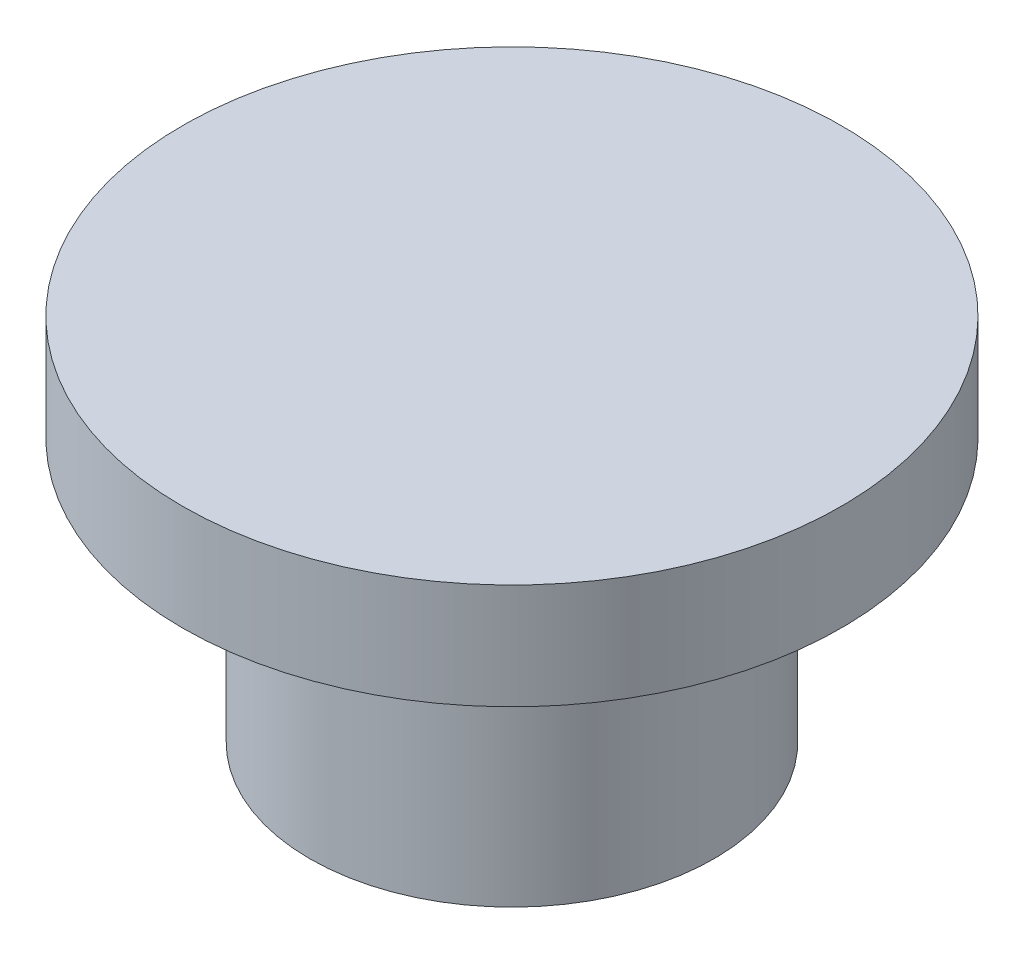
from build123d import *

# Parameters (mm, degrees)
ESQUISSE1_R      = 7.665
EXTRUSION1_DEPTH = 10
ESQUISSE2_R      = 12.5
EXTRUSION2_DEPTH = 4


with BuildPart() as part:
    # Esquisse1 → Extrusion1 (new body)
    with BuildSketch(Plane(origin=(0, 0, 0), x_dir=(1, 0, 0), z_dir=(0, 1, 0))):
        with Locations(Location((0, 0, 0), (0, 0, 270))):
            Circle(ESQUISSE1_R)
    extrude(amount=EXTRUSION1_DEPTH)

    # Esquisse2 → Extrusion2 (add)
    with BuildSketch(Plane(origin=(0, 10, 0), x_dir=(1, 0, 0), z_dir=(0, 1, 0))):
        with Locations(Location((0, 0, 0), (0, 0, 270))):
            Circle(ESQUISSE2_R)
    extrude(amount=EXTRUSION2_DEPTH)


solid = part.part
